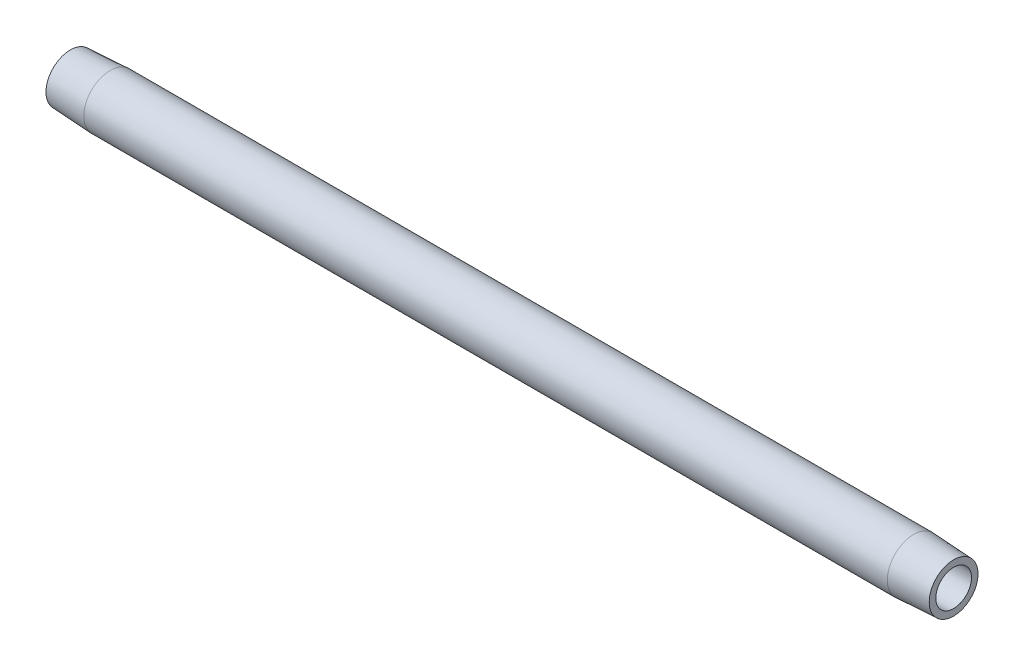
ISO-10303-21;
HEADER;
FILE_DESCRIPTION(('STEP AP214'),'2;1');
FILE_NAME('part.step','',(''),(''),'','','');
FILE_SCHEMA(('AUTOMOTIVE_DESIGN { 1 0 10303 214 1 1 1 1 }'));
ENDSEC;
DATA;
#1=APPLICATION_CONTEXT('core data for automotive mechanical design processes');
#2=APPLICATION_PROTOCOL_DEFINITION('international standard','automotive_design',2000,#1);
#3=PRODUCT_CONTEXT('',#1,'mechanical');
#4=PRODUCT('Part','Part','',(#3));
#5=PRODUCT_RELATED_PRODUCT_CATEGORY('part','',(#4));
#6=PRODUCT_DEFINITION_FORMATION('','',#4);
#7=PRODUCT_DEFINITION_CONTEXT('part definition',#1,'design');
#8=PRODUCT_DEFINITION('design','',#6,#7);
#9=PRODUCT_DEFINITION_SHAPE('','',#8);
#10=(LENGTH_UNIT() NAMED_UNIT(*) SI_UNIT(.MILLI.,.METRE.));
#11=(NAMED_UNIT(*) PLANE_ANGLE_UNIT() SI_UNIT($,.RADIAN.));
#12=(NAMED_UNIT(*) SI_UNIT($,.STERADIAN.) SOLID_ANGLE_UNIT());
#13=UNCERTAINTY_MEASURE_WITH_UNIT(LENGTH_MEASURE(1.E-05),#10,'distance_accuracy_value','');
#14=(GEOMETRIC_REPRESENTATION_CONTEXT(3) GLOBAL_UNCERTAINTY_ASSIGNED_CONTEXT((#13)) GLOBAL_UNIT_ASSIGNED_CONTEXT((#10,
#11,#12)) REPRESENTATION_CONTEXT('',''));
#15=CARTESIAN_POINT('',(0.,0.,0.));
#16=DIRECTION('',(0.,0.,1.));
#17=DIRECTION('',(1.,0.,0.));
#18=AXIS2_PLACEMENT_3D('',#15,#16,#17);
#19=CARTESIAN_POINT('',(228.6,0.,-4.62277681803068));
#20=DIRECTION('',(-1.,0.,0.));
#21=DIRECTION('',(0.,0.,1.));
#22=AXIS2_PLACEMENT_3D('',#19,#20,#21);
#23=PLANE('',#22);
#24=CARTESIAN_POINT('',(228.6,0.,0.));
#25=DIRECTION('',(-1.,0.,0.));
#26=DIRECTION('',(0.,0.,1.));
#27=AXIS2_PLACEMENT_3D('',#24,#25,#26);
#28=CIRCLE('',#27,6.31752683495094);
#29=CARTESIAN_POINT('',(228.6,0.,6.31752683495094));
#30=VERTEX_POINT('',#29);
#31=EDGE_CURVE('E10',#30,#30,#28,.T.);
#32=ORIENTED_EDGE('',*,*,#31,.F.);
#33=EDGE_LOOP('',(#32));
#34=FACE_BOUND('',#33,.T.);
#35=CARTESIAN_POINT('',(228.6,0.,0.));
#36=DIRECTION('',(-1.,0.,0.));
#37=DIRECTION('',(0.,0.,1.));
#38=AXIS2_PLACEMENT_3D('',#35,#36,#37);
#39=CIRCLE('',#38,4.62277681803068);
#40=CARTESIAN_POINT('',(228.6,0.,4.62277681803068));
#41=VERTEX_POINT('',#40);
#42=EDGE_CURVE('E52',#41,#41,#39,.T.);
#43=ORIENTED_EDGE('',*,*,#42,.T.);
#44=EDGE_LOOP('',(#43));
#45=FACE_BOUND('',#44,.T.);
#46=ADVANCED_FACE('F30',(#34,#45),#23,.F.);
#47=CARTESIAN_POINT('',(228.6,0.,0.));
#48=DIRECTION('',(-1.,0.,0.));
#49=DIRECTION('',(0.,0.,1.));
#50=AXIS2_PLACEMENT_3D('',#47,#48,#49);
#51=CONICAL_SURFACE('',#50,6.31752683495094,0.052359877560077);
#52=CARTESIAN_POINT('',(218.287600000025,0.,0.));
#53=DIRECTION('',(-1.,0.,0.));
#54=DIRECTION('',(0.,0.,1.));
#55=AXIS2_PLACEMENT_3D('',#52,#53,#54);
#56=CIRCLE('',#55,6.85797681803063);
#57=CARTESIAN_POINT('',(218.287600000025,0.,6.85797681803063));
#58=VERTEX_POINT('',#57);
#59=EDGE_CURVE('E36',#58,#58,#56,.T.);
#60=ORIENTED_EDGE('',*,*,#59,.F.);
#61=EDGE_LOOP('',(#60));
#62=FACE_BOUND('',#61,.T.);
#63=ORIENTED_EDGE('',*,*,#31,.T.);
#64=EDGE_LOOP('',(#63));
#65=FACE_BOUND('',#64,.T.);
#66=ADVANCED_FACE('F77',(#62,#65),#51,.T.);
#67=CARTESIAN_POINT('',(-6.37599469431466,0.,0.));
#68=DIRECTION('',(-1.,0.,0.));
#69=DIRECTION('',(0.,0.,1.));
#70=AXIS2_PLACEMENT_3D('',#67,#68,#69);
#71=CYLINDRICAL_SURFACE('',#70,6.85797681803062);
#72=CARTESIAN_POINT('',(10.3123999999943,0.,0.));
#73=DIRECTION('',(-1.,0.,0.));
#74=DIRECTION('',(0.,0.,1.));
#75=AXIS2_PLACEMENT_3D('',#72,#73,#74);
#76=CIRCLE('',#75,6.8579768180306);
#77=CARTESIAN_POINT('',(10.3123999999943,0.,6.8579768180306));
#78=VERTEX_POINT('',#77);
#79=EDGE_CURVE('E40',#78,#78,#76,.T.);
#80=ORIENTED_EDGE('',*,*,#79,.F.);
#81=EDGE_LOOP('',(#80));
#82=FACE_BOUND('',#81,.T.);
#83=ORIENTED_EDGE('',*,*,#59,.T.);
#84=EDGE_LOOP('',(#83));
#85=FACE_BOUND('',#84,.T.);
#86=ADVANCED_FACE('F72',(#82,#85),#71,.T.);
#87=CARTESIAN_POINT('',(10.3123999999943,0.,0.));
#88=DIRECTION('',(1.,0.,0.));
#89=DIRECTION('',(0.,0.,-1.));
#90=AXIS2_PLACEMENT_3D('',#87,#88,#89);
#91=CONICAL_SURFACE('',#90,6.8579768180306,0.0523598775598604);
#92=CARTESIAN_POINT('',(1.90819582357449E-11,0.,0.));
#93=DIRECTION('',(-1.,0.,0.));
#94=DIRECTION('',(0.,0.,1.));
#95=AXIS2_PLACEMENT_3D('',#92,#93,#94);
#96=CIRCLE('',#95,6.31752683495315);
#97=CARTESIAN_POINT('',(1.90819582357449E-11,0.,6.31752683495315));
#98=VERTEX_POINT('',#97);
#99=EDGE_CURVE('E44',#98,#98,#96,.T.);
#100=ORIENTED_EDGE('',*,*,#99,.F.);
#101=EDGE_LOOP('',(#100));
#102=FACE_BOUND('',#101,.T.);
#103=ORIENTED_EDGE('',*,*,#79,.T.);
#104=EDGE_LOOP('',(#103));
#105=FACE_BOUND('',#104,.T.);
#106=ADVANCED_FACE('F66',(#102,#105),#91,.T.);
#107=CARTESIAN_POINT('',(1.90819582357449E-11,0.,-6.31752683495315));
#108=DIRECTION('',(1.,0.,0.));
#109=DIRECTION('',(0.,0.,-1.));
#110=AXIS2_PLACEMENT_3D('',#107,#108,#109);
#111=PLANE('',#110);
#112=CARTESIAN_POINT('',(1.90819582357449E-11,0.,0.));
#113=DIRECTION('',(-1.,0.,0.));
#114=DIRECTION('',(0.,0.,1.));
#115=AXIS2_PLACEMENT_3D('',#112,#113,#114);
#116=CIRCLE('',#115,4.62277681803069);
#117=CARTESIAN_POINT('',(1.90819582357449E-11,0.,4.62277681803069));
#118=VERTEX_POINT('',#117);
#119=EDGE_CURVE('E49',#118,#118,#116,.T.);
#120=ORIENTED_EDGE('',*,*,#119,.F.);
#121=EDGE_LOOP('',(#120));
#122=FACE_BOUND('',#121,.T.);
#123=ORIENTED_EDGE('',*,*,#99,.T.);
#124=EDGE_LOOP('',(#123));
#125=FACE_BOUND('',#124,.T.);
#126=ADVANCED_FACE('F60',(#122,#125),#111,.F.);
#127=CARTESIAN_POINT('',(-6.37599469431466,0.,0.));
#128=DIRECTION('',(-1.,0.,0.));
#129=DIRECTION('',(0.,0.,1.));
#130=AXIS2_PLACEMENT_3D('',#127,#128,#129);
#131=CYLINDRICAL_SURFACE('',#130,4.62277681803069);
#132=ORIENTED_EDGE('',*,*,#42,.F.);
#133=EDGE_LOOP('',(#132));
#134=FACE_BOUND('',#133,.T.);
#135=ORIENTED_EDGE('',*,*,#119,.T.);
#136=EDGE_LOOP('',(#135));
#137=FACE_BOUND('',#136,.T.);
#138=ADVANCED_FACE('F57',(#134,#137),#131,.F.);
#139=CLOSED_SHELL('',(#46,#66,#86,#106,#126,#138));
#140=MANIFOLD_SOLID_BREP('B2',#139);
#141=ADVANCED_BREP_SHAPE_REPRESENTATION('',(#18,#140),#14);
#142=SHAPE_DEFINITION_REPRESENTATION(#9,#141);
ENDSEC;
END-ISO-10303-21;
